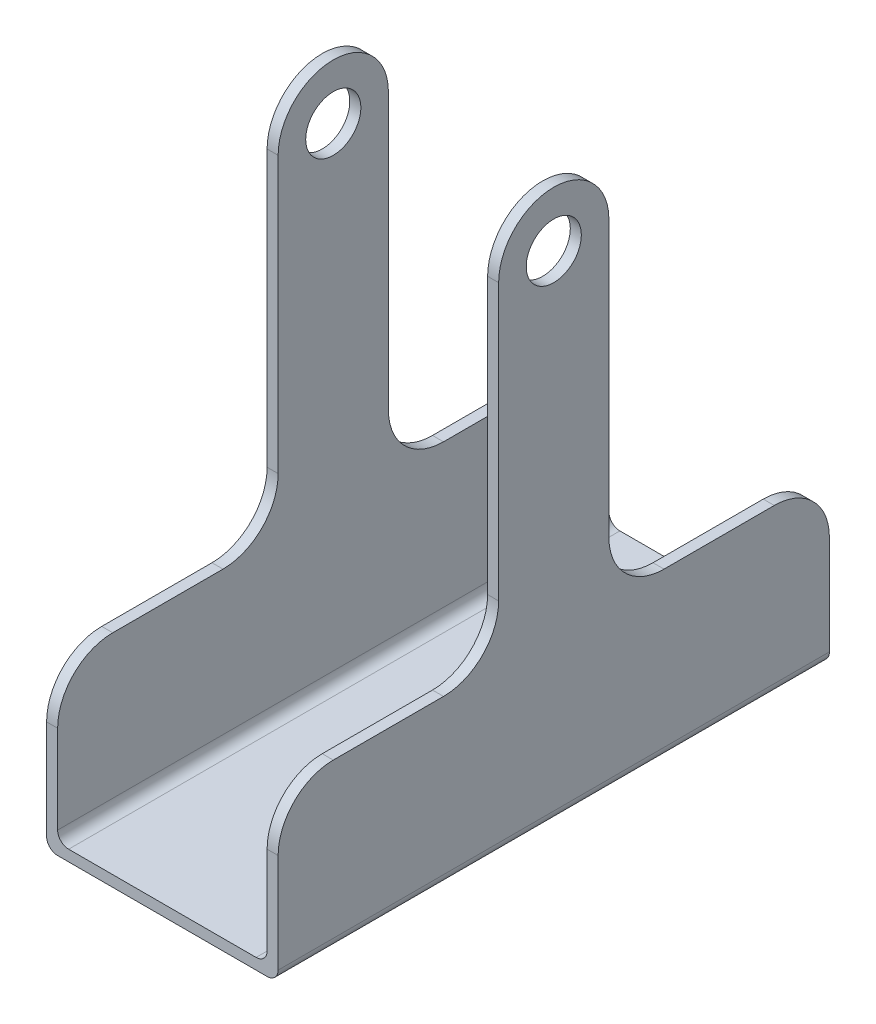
ISO-10303-21;
HEADER;
FILE_DESCRIPTION(('STEP AP214'),'2;1');
FILE_NAME('part.step','',(''),(''),'','','');
FILE_SCHEMA(('AUTOMOTIVE_DESIGN { 1 0 10303 214 1 1 1 1 }'));
ENDSEC;
DATA;
#1=APPLICATION_CONTEXT('core data for automotive mechanical design processes');
#2=APPLICATION_PROTOCOL_DEFINITION('international standard','automotive_design',2000,#1);
#3=PRODUCT_CONTEXT('',#1,'mechanical');
#4=PRODUCT('Part','Part','',(#3));
#5=PRODUCT_RELATED_PRODUCT_CATEGORY('part','',(#4));
#6=PRODUCT_DEFINITION_FORMATION('','',#4);
#7=PRODUCT_DEFINITION_CONTEXT('part definition',#1,'design');
#8=PRODUCT_DEFINITION('design','',#6,#7);
#9=PRODUCT_DEFINITION_SHAPE('','',#8);
#10=(LENGTH_UNIT() NAMED_UNIT(*) SI_UNIT(.MILLI.,.METRE.));
#11=(NAMED_UNIT(*) PLANE_ANGLE_UNIT() SI_UNIT($,.RADIAN.));
#12=(NAMED_UNIT(*) SI_UNIT($,.STERADIAN.) SOLID_ANGLE_UNIT());
#13=UNCERTAINTY_MEASURE_WITH_UNIT(LENGTH_MEASURE(1.E-05),#10,'distance_accuracy_value','');
#14=(GEOMETRIC_REPRESENTATION_CONTEXT(3) GLOBAL_UNCERTAINTY_ASSIGNED_CONTEXT((#13)) GLOBAL_UNIT_ASSIGNED_CONTEXT((#10,
#11,#12)) REPRESENTATION_CONTEXT('',''));
#15=CARTESIAN_POINT('',(0.,0.,0.));
#16=DIRECTION('',(0.,0.,1.));
#17=DIRECTION('',(1.,0.,0.));
#18=AXIS2_PLACEMENT_3D('',#15,#16,#17);
#19=CARTESIAN_POINT('',(0.,1.,0.));
#20=DIRECTION('',(0.,0.,-1.));
#21=DIRECTION('',(-1.,0.,0.));
#22=AXIS2_PLACEMENT_3D('',#19,#20,#21);
#23=PLANE('',#22);
#24=DIRECTION('',(1.,0.,0.));
#25=VECTOR('',#24,1.);
#26=CARTESIAN_POINT('',(0.,0.,0.));
#27=LINE('',#26,#25);
#28=CARTESIAN_POINT('',(0.,0.,0.));
#29=VERTEX_POINT('',#28);
#30=CARTESIAN_POINT('',(19.,0.,0.));
#31=VERTEX_POINT('',#30);
#32=EDGE_CURVE('E422',#29,#31,#27,.T.);
#33=ORIENTED_EDGE('',*,*,#32,.T.);
#34=CARTESIAN_POINT('',(19.,1.,0.));
#35=DIRECTION('',(0.,0.,-1.));
#36=DIRECTION('',(-1.,0.,0.));
#37=AXIS2_PLACEMENT_3D('',#34,#35,#36);
#38=CIRCLE('',#37,1.);
#39=CARTESIAN_POINT('',(20.,1.,0.));
#40=VERTEX_POINT('',#39);
#41=EDGE_CURVE('E37',#31,#40,#38,.F.);
#42=ORIENTED_EDGE('',*,*,#41,.T.);
#43=DIRECTION('',(0.,-1.,0.));
#44=VECTOR('',#43,1.);
#45=CARTESIAN_POINT('',(20.,0.,0.));
#46=LINE('',#45,#44);
#47=CARTESIAN_POINT('',(20.,9.99999999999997,0.));
#48=VERTEX_POINT('',#47);
#49=EDGE_CURVE('E399',#48,#40,#46,.T.);
#50=ORIENTED_EDGE('',*,*,#49,.F.);
#51=DIRECTION('',(-1.,0.,0.));
#52=VECTOR('',#51,1.);
#53=CARTESIAN_POINT('',(20.,9.99999999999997,0.));
#54=LINE('',#53,#52);
#55=CARTESIAN_POINT('',(19.,9.99999999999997,0.));
#56=VERTEX_POINT('',#55);
#57=EDGE_CURVE('E309',#48,#56,#54,.T.);
#58=ORIENTED_EDGE('',*,*,#57,.T.);
#59=DIRECTION('',(0.,-1.,0.));
#60=VECTOR('',#59,1.);
#61=CARTESIAN_POINT('',(19.,0.,0.));
#62=LINE('',#61,#60);
#63=CARTESIAN_POINT('',(19.,2.,0.));
#64=VERTEX_POINT('',#63);
#65=EDGE_CURVE('E385',#56,#64,#62,.T.);
#66=ORIENTED_EDGE('',*,*,#65,.T.);
#67=CARTESIAN_POINT('',(18.,2.,0.));
#68=DIRECTION('',(0.,0.,-1.));
#69=DIRECTION('',(-1.,0.,0.));
#70=AXIS2_PLACEMENT_3D('',#67,#68,#69);
#71=CIRCLE('',#70,1.);
#72=CARTESIAN_POINT('',(18.,1.,0.));
#73=VERTEX_POINT('',#72);
#74=EDGE_CURVE('E406',#64,#73,#71,.T.);
#75=ORIENTED_EDGE('',*,*,#74,.T.);
#76=DIRECTION('',(1.,0.,0.));
#77=VECTOR('',#76,1.);
#78=CARTESIAN_POINT('',(0.,1.,0.));
#79=LINE('',#78,#77);
#80=CARTESIAN_POINT('',(1.,1.,0.));
#81=VERTEX_POINT('',#80);
#82=EDGE_CURVE('E373',#81,#73,#79,.T.);
#83=ORIENTED_EDGE('',*,*,#82,.F.);
#84=CARTESIAN_POINT('',(1.,2.,0.));
#85=DIRECTION('',(0.,0.,-1.));
#86=DIRECTION('',(-1.,0.,0.));
#87=AXIS2_PLACEMENT_3D('',#84,#85,#86);
#88=CIRCLE('',#87,1.);
#89=CARTESIAN_POINT('',(0.,2.,0.));
#90=VERTEX_POINT('',#89);
#91=EDGE_CURVE('E364',#81,#90,#88,.T.);
#92=ORIENTED_EDGE('',*,*,#91,.T.);
#93=DIRECTION('',(0.,1.,0.));
#94=VECTOR('',#93,1.);
#95=CARTESIAN_POINT('',(0.,0.,0.));
#96=LINE('',#95,#94);
#97=CARTESIAN_POINT('',(0.,9.99999999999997,0.));
#98=VERTEX_POINT('',#97);
#99=EDGE_CURVE('E351',#90,#98,#96,.T.);
#100=ORIENTED_EDGE('',*,*,#99,.T.);
#101=CARTESIAN_POINT('',(-1.,9.99999999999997,0.));
#102=VERTEX_POINT('',#101);
#103=EDGE_CURVE('E312',#98,#102,#54,.T.);
#104=ORIENTED_EDGE('',*,*,#103,.T.);
#105=DIRECTION('',(0.,1.,0.));
#106=VECTOR('',#105,1.);
#107=CARTESIAN_POINT('',(-1.,0.,0.));
#108=LINE('',#107,#106);
#109=CARTESIAN_POINT('',(-1.,1.,0.));
#110=VERTEX_POINT('',#109);
#111=EDGE_CURVE('E506',#110,#102,#108,.T.);
#112=ORIENTED_EDGE('',*,*,#111,.F.);
#113=CARTESIAN_POINT('',(0.,1.,0.));
#114=DIRECTION('',(0.,0.,-1.));
#115=DIRECTION('',(-1.,0.,0.));
#116=AXIS2_PLACEMENT_3D('',#113,#114,#115);
#117=CIRCLE('',#116,1.);
#118=EDGE_CURVE('E44',#110,#29,#117,.F.);
#119=ORIENTED_EDGE('',*,*,#118,.T.);
#120=EDGE_LOOP('',(#33,#42,#50,#58,#66,#75,#83,#92,#100,#104,#112,#119));
#121=FACE_BOUND('',#120,.T.);
#122=ADVANCED_FACE('F30',(#121),#23,.F.);
#123=CARTESIAN_POINT('',(0.,1.,-50.));
#124=DIRECTION('',(0.,0.,1.));
#125=DIRECTION('',(1.,0.,0.));
#126=AXIS2_PLACEMENT_3D('',#123,#124,#125);
#127=PLANE('',#126);
#128=DIRECTION('',(0.,1.,0.));
#129=VECTOR('',#128,1.);
#130=CARTESIAN_POINT('',(20.,0.,-50.));
#131=LINE('',#130,#129);
#132=CARTESIAN_POINT('',(20.,1.,-50.));
#133=VERTEX_POINT('',#132);
#134=CARTESIAN_POINT('',(20.,9.99999999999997,-50.));
#135=VERTEX_POINT('',#134);
#136=EDGE_CURVE('E430',#133,#135,#131,.T.);
#137=ORIENTED_EDGE('',*,*,#136,.F.);
#138=CARTESIAN_POINT('',(19.,1.,-50.));
#139=DIRECTION('',(0.,0.,1.));
#140=DIRECTION('',(1.,0.,0.));
#141=AXIS2_PLACEMENT_3D('',#138,#139,#140);
#142=CIRCLE('',#141,1.);
#143=CARTESIAN_POINT('',(19.,0.,-50.));
#144=VERTEX_POINT('',#143);
#145=EDGE_CURVE('E413',#133,#144,#142,.F.);
#146=ORIENTED_EDGE('',*,*,#145,.T.);
#147=DIRECTION('',(-1.,0.,0.));
#148=VECTOR('',#147,1.);
#149=CARTESIAN_POINT('',(0.,0.,-50.));
#150=LINE('',#149,#148);
#151=CARTESIAN_POINT('',(0.,0.,-50.));
#152=VERTEX_POINT('',#151);
#153=EDGE_CURVE('E378',#144,#152,#150,.T.);
#154=ORIENTED_EDGE('',*,*,#153,.T.);
#155=CARTESIAN_POINT('',(0.,1.,-50.));
#156=DIRECTION('',(0.,0.,1.));
#157=DIRECTION('',(1.,0.,0.));
#158=AXIS2_PLACEMENT_3D('',#155,#156,#157);
#159=CIRCLE('',#158,1.);
#160=CARTESIAN_POINT('',(-1.,1.,-50.));
#161=VERTEX_POINT('',#160);
#162=EDGE_CURVE('E411',#152,#161,#159,.F.);
#163=ORIENTED_EDGE('',*,*,#162,.T.);
#164=DIRECTION('',(0.,-1.,0.));
#165=VECTOR('',#164,1.);
#166=CARTESIAN_POINT('',(-1.,0.,-50.));
#167=LINE('',#166,#165);
#168=CARTESIAN_POINT('',(-1.,9.99999999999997,-50.));
#169=VERTEX_POINT('',#168);
#170=EDGE_CURVE('E503',#169,#161,#167,.T.);
#171=ORIENTED_EDGE('',*,*,#170,.F.);
#172=DIRECTION('',(-1.,0.,0.));
#173=VECTOR('',#172,1.);
#174=CARTESIAN_POINT('',(20.,9.99999999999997,-50.));
#175=LINE('',#174,#173);
#176=CARTESIAN_POINT('',(0.,9.99999999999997,-50.));
#177=VERTEX_POINT('',#176);
#178=EDGE_CURVE('E308',#177,#169,#175,.T.);
#179=ORIENTED_EDGE('',*,*,#178,.F.);
#180=DIRECTION('',(0.,-1.,0.));
#181=VECTOR('',#180,1.);
#182=CARTESIAN_POINT('',(0.,0.,-50.));
#183=LINE('',#182,#181);
#184=CARTESIAN_POINT('',(0.,2.,-50.));
#185=VERTEX_POINT('',#184);
#186=EDGE_CURVE('E359',#177,#185,#183,.T.);
#187=ORIENTED_EDGE('',*,*,#186,.T.);
#188=CARTESIAN_POINT('',(1.,2.,-50.));
#189=DIRECTION('',(0.,0.,1.));
#190=DIRECTION('',(1.,0.,0.));
#191=AXIS2_PLACEMENT_3D('',#188,#189,#190);
#192=CIRCLE('',#191,1.);
#193=CARTESIAN_POINT('',(1.,1.,-50.));
#194=VERTEX_POINT('',#193);
#195=EDGE_CURVE('E366',#185,#194,#192,.T.);
#196=ORIENTED_EDGE('',*,*,#195,.T.);
#197=DIRECTION('',(-1.,0.,0.));
#198=VECTOR('',#197,1.);
#199=CARTESIAN_POINT('',(0.,1.,-50.));
#200=LINE('',#199,#198);
#201=CARTESIAN_POINT('',(18.,1.,-50.));
#202=VERTEX_POINT('',#201);
#203=EDGE_CURVE('E370',#202,#194,#200,.T.);
#204=ORIENTED_EDGE('',*,*,#203,.F.);
#205=CARTESIAN_POINT('',(18.,2.,-50.));
#206=DIRECTION('',(0.,0.,1.));
#207=DIRECTION('',(1.,0.,0.));
#208=AXIS2_PLACEMENT_3D('',#205,#206,#207);
#209=CIRCLE('',#208,1.);
#210=CARTESIAN_POINT('',(19.,2.,-50.));
#211=VERTEX_POINT('',#210);
#212=EDGE_CURVE('E404',#202,#211,#209,.T.);
#213=ORIENTED_EDGE('',*,*,#212,.T.);
#214=DIRECTION('',(0.,1.,0.));
#215=VECTOR('',#214,1.);
#216=CARTESIAN_POINT('',(19.,0.,-50.));
#217=LINE('',#216,#215);
#218=CARTESIAN_POINT('',(19.,9.99999999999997,-50.));
#219=VERTEX_POINT('',#218);
#220=EDGE_CURVE('E389',#211,#219,#217,.T.);
#221=ORIENTED_EDGE('',*,*,#220,.T.);
#222=EDGE_CURVE('E305',#135,#219,#175,.T.);
#223=ORIENTED_EDGE('',*,*,#222,.F.);
#224=EDGE_LOOP('',(#137,#146,#154,#163,#171,#179,#187,#196,#204,#213,#221,#223));
#225=FACE_BOUND('',#224,.T.);
#226=ADVANCED_FACE('F434',(#225),#127,.F.);
#227=CARTESIAN_POINT('',(0.,1.,-50.));
#228=DIRECTION('',(0.,-1.,0.));
#229=DIRECTION('',(0.,0.,-1.));
#230=AXIS2_PLACEMENT_3D('',#227,#228,#229);
#231=PLANE('',#230);
#232=ORIENTED_EDGE('',*,*,#82,.T.);
#233=DIRECTION('',(0.,0.,-1.));
#234=VECTOR('',#233,1.);
#235=CARTESIAN_POINT('',(18.,1.,-50.));
#236=LINE('',#235,#234);
#237=EDGE_CURVE('E369',#73,#202,#236,.T.);
#238=ORIENTED_EDGE('',*,*,#237,.T.);
#239=ORIENTED_EDGE('',*,*,#203,.T.);
#240=DIRECTION('',(0.,0.,1.));
#241=VECTOR('',#240,1.);
#242=CARTESIAN_POINT('',(1.,1.,0.));
#243=LINE('',#242,#241);
#244=EDGE_CURVE('E360',#194,#81,#243,.T.);
#245=ORIENTED_EDGE('',*,*,#244,.T.);
#246=EDGE_LOOP('',(#232,#238,#239,#245));
#247=FACE_BOUND('',#246,.T.);
#248=ADVANCED_FACE('F459',(#247),#231,.F.);
#249=CARTESIAN_POINT('',(0.,0.,-50.));
#250=DIRECTION('',(0.,-1.,0.));
#251=DIRECTION('',(0.,0.,-1.));
#252=AXIS2_PLACEMENT_3D('',#249,#250,#251);
#253=PLANE('',#252);
#254=ORIENTED_EDGE('',*,*,#153,.F.);
#255=DIRECTION('',(0.,0.,-1.));
#256=VECTOR('',#255,1.);
#257=CARTESIAN_POINT('',(19.,0.,0.));
#258=LINE('',#257,#256);
#259=EDGE_CURVE('E51',#144,#31,#258,.F.);
#260=ORIENTED_EDGE('',*,*,#259,.T.);
#261=ORIENTED_EDGE('',*,*,#32,.F.);
#262=DIRECTION('',(0.,0.,1.));
#263=VECTOR('',#262,1.);
#264=CARTESIAN_POINT('',(0.,0.,-50.));
#265=LINE('',#264,#263);
#266=EDGE_CURVE('E415',#29,#152,#265,.F.);
#267=ORIENTED_EDGE('',*,*,#266,.T.);
#268=EDGE_LOOP('',(#254,#260,#261,#267));
#269=FACE_BOUND('',#268,.T.);
#270=ADVANCED_FACE('F437',(#269),#253,.T.);
#271=CARTESIAN_POINT('',(19.,50.,0.));
#272=DIRECTION('',(-1.,0.,0.));
#273=DIRECTION('',(0.,0.,1.));
#274=AXIS2_PLACEMENT_3D('',#271,#272,#273);
#275=PLANE('',#274);
#276=ORIENTED_EDGE('',*,*,#220,.F.);
#277=DIRECTION('',(0.,0.,-1.));
#278=VECTOR('',#277,1.);
#279=CARTESIAN_POINT('',(19.,2.,0.));
#280=LINE('',#279,#278);
#281=EDGE_CURVE('E402',#211,#64,#280,.F.);
#282=ORIENTED_EDGE('',*,*,#281,.T.);
#283=ORIENTED_EDGE('',*,*,#65,.F.);
#284=CARTESIAN_POINT('',(19.,10.,-5.));
#285=DIRECTION('',(-1.,0.,0.));
#286=DIRECTION('',(0.,0.,1.));
#287=AXIS2_PLACEMENT_3D('',#284,#285,#286);
#288=CIRCLE('',#287,5.);
#289=CARTESIAN_POINT('',(19.,15.,-5.00000000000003));
#290=VERTEX_POINT('',#289);
#291=EDGE_CURVE('E335',#290,#56,#288,.F.);
#292=ORIENTED_EDGE('',*,*,#291,.F.);
#293=DIRECTION('',(0.,0.,1.));
#294=VECTOR('',#293,1.);
#295=CARTESIAN_POINT('',(19.,15.,0.));
#296=LINE('',#295,#294);
#297=CARTESIAN_POINT('',(19.,15.,-15.));
#298=VERTEX_POINT('',#297);
#299=EDGE_CURVE('E333',#298,#290,#296,.T.);
#300=ORIENTED_EDGE('',*,*,#299,.F.);
#301=CARTESIAN_POINT('',(19.,20.,-15.));
#302=DIRECTION('',(-1.,0.,0.));
#303=DIRECTION('',(0.,0.,1.));
#304=AXIS2_PLACEMENT_3D('',#301,#302,#303);
#305=CIRCLE('',#304,5.);
#306=CARTESIAN_POINT('',(19.,20.,-20.));
#307=VERTEX_POINT('',#306);
#308=EDGE_CURVE('E331',#307,#298,#305,.T.);
#309=ORIENTED_EDGE('',*,*,#308,.F.);
#310=DIRECTION('',(0.,-1.,0.));
#311=VECTOR('',#310,1.);
#312=CARTESIAN_POINT('',(19.,50.,-20.));
#313=LINE('',#312,#311);
#314=CARTESIAN_POINT('',(19.,45.,-20.));
#315=VERTEX_POINT('',#314);
#316=EDGE_CURVE('E329',#315,#307,#313,.T.);
#317=ORIENTED_EDGE('',*,*,#316,.F.);
#318=CARTESIAN_POINT('',(19.,45.,-25.));
#319=DIRECTION('',(-1.,0.,0.));
#320=DIRECTION('',(0.,0.,1.));
#321=AXIS2_PLACEMENT_3D('',#318,#319,#320);
#322=CIRCLE('',#321,5.);
#323=CARTESIAN_POINT('',(19.,45.,-30.));
#324=VERTEX_POINT('',#323);
#325=EDGE_CURVE('E327',#324,#315,#322,.F.);
#326=ORIENTED_EDGE('',*,*,#325,.F.);
#327=DIRECTION('',(0.,1.,0.));
#328=VECTOR('',#327,1.);
#329=CARTESIAN_POINT('',(19.,50.,-30.));
#330=LINE('',#329,#328);
#331=CARTESIAN_POINT('',(19.,20.,-30.));
#332=VERTEX_POINT('',#331);
#333=EDGE_CURVE('E343',#332,#324,#330,.T.);
#334=ORIENTED_EDGE('',*,*,#333,.F.);
#335=CARTESIAN_POINT('',(19.,20.,-35.));
#336=DIRECTION('',(-1.,0.,0.));
#337=DIRECTION('',(0.,0.,1.));
#338=AXIS2_PLACEMENT_3D('',#335,#336,#337);
#339=CIRCLE('',#338,5.);
#340=CARTESIAN_POINT('',(19.,15.,-35.));
#341=VERTEX_POINT('',#340);
#342=EDGE_CURVE('E341',#341,#332,#339,.T.);
#343=ORIENTED_EDGE('',*,*,#342,.F.);
#344=DIRECTION('',(0.,0.,1.));
#345=VECTOR('',#344,1.);
#346=CARTESIAN_POINT('',(19.,15.,0.));
#347=LINE('',#346,#345);
#348=CARTESIAN_POINT('',(19.,15.,-45.));
#349=VERTEX_POINT('',#348);
#350=EDGE_CURVE('E339',#349,#341,#347,.T.);
#351=ORIENTED_EDGE('',*,*,#350,.F.);
#352=CARTESIAN_POINT('',(19.,10.,-45.));
#353=DIRECTION('',(-1.,0.,0.));
#354=DIRECTION('',(0.,0.,1.));
#355=AXIS2_PLACEMENT_3D('',#352,#353,#354);
#356=CIRCLE('',#355,5.);
#357=EDGE_CURVE('E337',#219,#349,#356,.F.);
#358=ORIENTED_EDGE('',*,*,#357,.F.);
#359=EDGE_LOOP('',(#276,#282,#283,#292,#300,#309,#317,#326,#334,#343,#351,#358));
#360=FACE_BOUND('',#359,.T.);
#361=CARTESIAN_POINT('',(19.,45.,-25.));
#362=DIRECTION('',(1.,0.,0.));
#363=DIRECTION('',(0.,0.,-1.));
#364=AXIS2_PLACEMENT_3D('',#361,#362,#363);
#365=CIRCLE('',#364,2.5);
#366=CARTESIAN_POINT('',(19.,45.,-27.5));
#367=VERTEX_POINT('',#366);
#368=EDGE_CURVE('E505',#367,#367,#365,.T.);
#369=ORIENTED_EDGE('',*,*,#368,.T.);
#370=EDGE_LOOP('',(#369));
#371=FACE_BOUND('',#370,.T.);
#372=ADVANCED_FACE('F447',(#360,#371),#275,.T.);
#373=CARTESIAN_POINT('',(20.,50.,0.));
#374=DIRECTION('',(-1.,0.,0.));
#375=DIRECTION('',(0.,0.,1.));
#376=AXIS2_PLACEMENT_3D('',#373,#374,#375);
#377=PLANE('',#376);
#378=ORIENTED_EDGE('',*,*,#49,.T.);
#379=DIRECTION('',(0.,0.,-1.));
#380=VECTOR('',#379,1.);
#381=CARTESIAN_POINT('',(20.,1.,-50.));
#382=LINE('',#381,#380);
#383=EDGE_CURVE('E408',#40,#133,#382,.T.);
#384=ORIENTED_EDGE('',*,*,#383,.T.);
#385=ORIENTED_EDGE('',*,*,#136,.T.);
#386=CARTESIAN_POINT('',(20.,10.,-45.));
#387=DIRECTION('',(1.,0.,0.));
#388=DIRECTION('',(0.,0.,-1.));
#389=AXIS2_PLACEMENT_3D('',#386,#387,#388);
#390=CIRCLE('',#389,5.);
#391=CARTESIAN_POINT('',(20.,15.,-45.));
#392=VERTEX_POINT('',#391);
#393=EDGE_CURVE('E278',#135,#392,#390,.T.);
#394=ORIENTED_EDGE('',*,*,#393,.T.);
#395=DIRECTION('',(0.,0.,1.));
#396=VECTOR('',#395,1.);
#397=CARTESIAN_POINT('',(20.,15.,-35.));
#398=LINE('',#397,#396);
#399=CARTESIAN_POINT('',(20.,15.,-35.));
#400=VERTEX_POINT('',#399);
#401=EDGE_CURVE('E281',#392,#400,#398,.T.);
#402=ORIENTED_EDGE('',*,*,#401,.T.);
#403=CARTESIAN_POINT('',(20.,20.,-35.));
#404=DIRECTION('',(-1.,0.,0.));
#405=DIRECTION('',(0.,0.,1.));
#406=AXIS2_PLACEMENT_3D('',#403,#404,#405);
#407=CIRCLE('',#406,5.);
#408=CARTESIAN_POINT('',(20.,20.,-30.));
#409=VERTEX_POINT('',#408);
#410=EDGE_CURVE('E284',#400,#409,#407,.T.);
#411=ORIENTED_EDGE('',*,*,#410,.T.);
#412=DIRECTION('',(0.,1.,0.));
#413=VECTOR('',#412,1.);
#414=CARTESIAN_POINT('',(20.,45.,-30.));
#415=LINE('',#414,#413);
#416=CARTESIAN_POINT('',(20.,45.,-30.));
#417=VERTEX_POINT('',#416);
#418=EDGE_CURVE('E227',#409,#417,#415,.T.);
#419=ORIENTED_EDGE('',*,*,#418,.T.);
#420=CARTESIAN_POINT('',(20.,45.,-25.));
#421=DIRECTION('',(1.,0.,0.));
#422=DIRECTION('',(0.,0.,1.));
#423=AXIS2_PLACEMENT_3D('',#420,#421,#422);
#424=CIRCLE('',#423,5.);
#425=CARTESIAN_POINT('',(20.,45.,-20.));
#426=VERTEX_POINT('',#425);
#427=EDGE_CURVE('E264',#417,#426,#424,.T.);
#428=ORIENTED_EDGE('',*,*,#427,.T.);
#429=DIRECTION('',(0.,-1.,0.));
#430=VECTOR('',#429,1.);
#431=CARTESIAN_POINT('',(20.,45.,-20.));
#432=LINE('',#431,#430);
#433=CARTESIAN_POINT('',(20.,20.,-20.));
#434=VERTEX_POINT('',#433);
#435=EDGE_CURVE('E266',#426,#434,#432,.T.);
#436=ORIENTED_EDGE('',*,*,#435,.T.);
#437=CARTESIAN_POINT('',(20.,20.,-15.));
#438=DIRECTION('',(-1.,0.,0.));
#439=DIRECTION('',(0.,0.,-1.));
#440=AXIS2_PLACEMENT_3D('',#437,#438,#439);
#441=CIRCLE('',#440,5.);
#442=CARTESIAN_POINT('',(20.,15.,-15.));
#443=VERTEX_POINT('',#442);
#444=EDGE_CURVE('E269',#434,#443,#441,.T.);
#445=ORIENTED_EDGE('',*,*,#444,.T.);
#446=DIRECTION('',(0.,0.,1.));
#447=VECTOR('',#446,1.);
#448=CARTESIAN_POINT('',(20.,15.,-15.));
#449=LINE('',#448,#447);
#450=CARTESIAN_POINT('',(20.,15.,-5.00000000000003));
#451=VERTEX_POINT('',#450);
#452=EDGE_CURVE('E272',#443,#451,#449,.T.);
#453=ORIENTED_EDGE('',*,*,#452,.T.);
#454=CARTESIAN_POINT('',(20.,10.,-5.));
#455=DIRECTION('',(1.,0.,0.));
#456=DIRECTION('',(0.,0.,1.));
#457=AXIS2_PLACEMENT_3D('',#454,#455,#456);
#458=CIRCLE('',#457,5.);
#459=EDGE_CURVE('E275',#451,#48,#458,.T.);
#460=ORIENTED_EDGE('',*,*,#459,.T.);
#461=EDGE_LOOP('',(#378,#384,#385,#394,#402,#411,#419,#428,#436,#445,#453,#460));
#462=FACE_BOUND('',#461,.T.);
#463=CARTESIAN_POINT('',(20.,45.,-25.));
#464=DIRECTION('',(1.,0.,0.));
#465=DIRECTION('',(0.,0.,-1.));
#466=AXIS2_PLACEMENT_3D('',#463,#464,#465);
#467=CIRCLE('',#466,2.5);
#468=CARTESIAN_POINT('',(20.,45.,-27.5));
#469=VERTEX_POINT('',#468);
#470=EDGE_CURVE('E390',#469,#469,#467,.T.);
#471=ORIENTED_EDGE('',*,*,#470,.F.);
#472=EDGE_LOOP('',(#471));
#473=FACE_BOUND('',#472,.T.);
#474=ADVANCED_FACE('F426',(#462,#473),#377,.F.);
#475=CARTESIAN_POINT('',(20.,45.,-25.));
#476=DIRECTION('',(-1.,0.,0.));
#477=DIRECTION('',(0.,0.,1.));
#478=AXIS2_PLACEMENT_3D('',#475,#476,#477);
#479=CYLINDRICAL_SURFACE('',#478,2.5);
#480=ORIENTED_EDGE('',*,*,#470,.T.);
#481=EDGE_LOOP('',(#480));
#482=FACE_BOUND('',#481,.T.);
#483=ORIENTED_EDGE('',*,*,#368,.F.);
#484=EDGE_LOOP('',(#483));
#485=FACE_BOUND('',#484,.T.);
#486=ADVANCED_FACE('F550',(#482,#485),#479,.F.);
#487=CARTESIAN_POINT('',(-1.,0.,0.));
#488=DIRECTION('',(-1.,0.,0.));
#489=DIRECTION('',(0.,0.,1.));
#490=AXIS2_PLACEMENT_3D('',#487,#488,#489);
#491=PLANE('',#490);
#492=ORIENTED_EDGE('',*,*,#170,.T.);
#493=DIRECTION('',(0.,0.,1.));
#494=VECTOR('',#493,1.);
#495=CARTESIAN_POINT('',(-1.,1.,0.));
#496=LINE('',#495,#494);
#497=EDGE_CURVE('E11',#161,#110,#496,.T.);
#498=ORIENTED_EDGE('',*,*,#497,.T.);
#499=ORIENTED_EDGE('',*,*,#111,.T.);
#500=CARTESIAN_POINT('',(-1.,10.,-5.));
#501=DIRECTION('',(1.,0.,0.));
#502=DIRECTION('',(0.,0.,1.));
#503=AXIS2_PLACEMENT_3D('',#500,#501,#502);
#504=CIRCLE('',#503,5.);
#505=CARTESIAN_POINT('',(-1.,15.,-5.00000000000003));
#506=VERTEX_POINT('',#505);
#507=EDGE_CURVE('E250',#506,#102,#504,.T.);
#508=ORIENTED_EDGE('',*,*,#507,.F.);
#509=DIRECTION('',(0.,0.,1.));
#510=VECTOR('',#509,1.);
#511=CARTESIAN_POINT('',(-1.,15.,-15.));
#512=LINE('',#511,#510);
#513=CARTESIAN_POINT('',(-1.,15.,-15.));
#514=VERTEX_POINT('',#513);
#515=EDGE_CURVE('E245',#514,#506,#512,.T.);
#516=ORIENTED_EDGE('',*,*,#515,.F.);
#517=CARTESIAN_POINT('',(-1.,20.,-15.));
#518=DIRECTION('',(-1.,0.,0.));
#519=DIRECTION('',(0.,0.,-1.));
#520=AXIS2_PLACEMENT_3D('',#517,#518,#519);
#521=CIRCLE('',#520,5.);
#522=CARTESIAN_POINT('',(-1.,20.,-20.));
#523=VERTEX_POINT('',#522);
#524=EDGE_CURVE('E243',#523,#514,#521,.T.);
#525=ORIENTED_EDGE('',*,*,#524,.F.);
#526=DIRECTION('',(0.,-1.,0.));
#527=VECTOR('',#526,1.);
#528=CARTESIAN_POINT('',(-1.,45.,-20.));
#529=LINE('',#528,#527);
#530=CARTESIAN_POINT('',(-1.,45.,-20.));
#531=VERTEX_POINT('',#530);
#532=EDGE_CURVE('E221',#531,#523,#529,.T.);
#533=ORIENTED_EDGE('',*,*,#532,.F.);
#534=CARTESIAN_POINT('',(-1.,45.,-25.));
#535=DIRECTION('',(1.,0.,0.));
#536=DIRECTION('',(0.,0.,1.));
#537=AXIS2_PLACEMENT_3D('',#534,#535,#536);
#538=CIRCLE('',#537,5.);
#539=CARTESIAN_POINT('',(-1.,45.,-30.));
#540=VERTEX_POINT('',#539);
#541=EDGE_CURVE('E230',#540,#531,#538,.T.);
#542=ORIENTED_EDGE('',*,*,#541,.F.);
#543=DIRECTION('',(0.,1.,0.));
#544=VECTOR('',#543,1.);
#545=CARTESIAN_POINT('',(-1.,45.,-30.));
#546=LINE('',#545,#544);
#547=CARTESIAN_POINT('',(-1.,20.,-30.));
#548=VERTEX_POINT('',#547);
#549=EDGE_CURVE('E262',#548,#540,#546,.T.);
#550=ORIENTED_EDGE('',*,*,#549,.F.);
#551=CARTESIAN_POINT('',(-1.,20.,-35.));
#552=DIRECTION('',(-1.,0.,0.));
#553=DIRECTION('',(0.,0.,1.));
#554=AXIS2_PLACEMENT_3D('',#551,#552,#553);
#555=CIRCLE('',#554,5.);
#556=CARTESIAN_POINT('',(-1.,15.,-35.));
#557=VERTEX_POINT('',#556);
#558=EDGE_CURVE('E259',#557,#548,#555,.T.);
#559=ORIENTED_EDGE('',*,*,#558,.F.);
#560=DIRECTION('',(0.,0.,1.));
#561=VECTOR('',#560,1.);
#562=CARTESIAN_POINT('',(-1.,15.,-35.));
#563=LINE('',#562,#561);
#564=CARTESIAN_POINT('',(-1.,15.,-45.));
#565=VERTEX_POINT('',#564);
#566=EDGE_CURVE('E256',#565,#557,#563,.T.);
#567=ORIENTED_EDGE('',*,*,#566,.F.);
#568=CARTESIAN_POINT('',(-1.,10.,-45.));
#569=DIRECTION('',(1.,0.,0.));
#570=DIRECTION('',(0.,0.,-1.));
#571=AXIS2_PLACEMENT_3D('',#568,#569,#570);
#572=CIRCLE('',#571,5.);
#573=EDGE_CURVE('E253',#169,#565,#572,.T.);
#574=ORIENTED_EDGE('',*,*,#573,.F.);
#575=EDGE_LOOP('',(#492,#498,#499,#508,#516,#525,#533,#542,#550,#559,#567,#574));
#576=FACE_BOUND('',#575,.T.);
#577=CARTESIAN_POINT('',(-1.,45.,-25.));
#578=DIRECTION('',(-1.,0.,0.));
#579=DIRECTION('',(0.,0.,1.));
#580=AXIS2_PLACEMENT_3D('',#577,#578,#579);
#581=CIRCLE('',#580,2.5);
#582=CARTESIAN_POINT('',(-1.,45.,-22.5));
#583=VERTEX_POINT('',#582);
#584=EDGE_CURVE('E348',#583,#583,#581,.T.);
#585=ORIENTED_EDGE('',*,*,#584,.F.);
#586=EDGE_LOOP('',(#585));
#587=FACE_BOUND('',#586,.T.);
#588=ADVANCED_FACE('F239',(#576,#587),#491,.T.);
#589=CARTESIAN_POINT('',(0.,0.,0.));
#590=DIRECTION('',(-1.,0.,0.));
#591=DIRECTION('',(0.,0.,1.));
#592=AXIS2_PLACEMENT_3D('',#589,#590,#591);
#593=PLANE('',#592);
#594=ORIENTED_EDGE('',*,*,#99,.F.);
#595=DIRECTION('',(0.,0.,1.));
#596=VECTOR('',#595,1.);
#597=CARTESIAN_POINT('',(0.,2.,-50.));
#598=LINE('',#597,#596);
#599=EDGE_CURVE('E362',#90,#185,#598,.F.);
#600=ORIENTED_EDGE('',*,*,#599,.T.);
#601=ORIENTED_EDGE('',*,*,#186,.F.);
#602=CARTESIAN_POINT('',(0.,10.,-45.));
#603=DIRECTION('',(-1.,0.,0.));
#604=DIRECTION('',(0.,0.,1.));
#605=AXIS2_PLACEMENT_3D('',#602,#603,#604);
#606=CIRCLE('',#605,5.);
#607=CARTESIAN_POINT('',(0.,15.,-45.));
#608=VERTEX_POINT('',#607);
#609=EDGE_CURVE('E391',#177,#608,#606,.F.);
#610=ORIENTED_EDGE('',*,*,#609,.T.);
#611=DIRECTION('',(0.,0.,1.));
#612=VECTOR('',#611,1.);
#613=CARTESIAN_POINT('',(0.,15.,0.));
#614=LINE('',#613,#612);
#615=CARTESIAN_POINT('',(0.,15.,-35.));
#616=VERTEX_POINT('',#615);
#617=EDGE_CURVE('E464',#608,#616,#614,.T.);
#618=ORIENTED_EDGE('',*,*,#617,.T.);
#619=CARTESIAN_POINT('',(0.,20.,-35.));
#620=DIRECTION('',(-1.,0.,0.));
#621=DIRECTION('',(0.,0.,1.));
#622=AXIS2_PLACEMENT_3D('',#619,#620,#621);
#623=CIRCLE('',#622,5.);
#624=CARTESIAN_POINT('',(0.,20.,-30.));
#625=VERTEX_POINT('',#624);
#626=EDGE_CURVE('E468',#616,#625,#623,.T.);
#627=ORIENTED_EDGE('',*,*,#626,.T.);
#628=DIRECTION('',(0.,1.,0.));
#629=VECTOR('',#628,1.);
#630=CARTESIAN_POINT('',(0.,0.,-30.));
#631=LINE('',#630,#629);
#632=CARTESIAN_POINT('',(0.,45.,-30.));
#633=VERTEX_POINT('',#632);
#634=EDGE_CURVE('E470',#625,#633,#631,.T.);
#635=ORIENTED_EDGE('',*,*,#634,.T.);
#636=CARTESIAN_POINT('',(0.,45.,-25.));
#637=DIRECTION('',(-1.,0.,0.));
#638=DIRECTION('',(0.,0.,1.));
#639=AXIS2_PLACEMENT_3D('',#636,#637,#638);
#640=CIRCLE('',#639,5.);
#641=CARTESIAN_POINT('',(0.,45.,-20.));
#642=VERTEX_POINT('',#641);
#643=EDGE_CURVE('E292',#633,#642,#640,.F.);
#644=ORIENTED_EDGE('',*,*,#643,.T.);
#645=DIRECTION('',(0.,-1.,0.));
#646=VECTOR('',#645,1.);
#647=CARTESIAN_POINT('',(0.,0.,-20.));
#648=LINE('',#647,#646);
#649=CARTESIAN_POINT('',(0.,20.,-20.));
#650=VERTEX_POINT('',#649);
#651=EDGE_CURVE('E224',#642,#650,#648,.T.);
#652=ORIENTED_EDGE('',*,*,#651,.T.);
#653=CARTESIAN_POINT('',(0.,20.,-15.));
#654=DIRECTION('',(-1.,0.,0.));
#655=DIRECTION('',(0.,0.,1.));
#656=AXIS2_PLACEMENT_3D('',#653,#654,#655);
#657=CIRCLE('',#656,5.);
#658=CARTESIAN_POINT('',(0.,15.,-15.));
#659=VERTEX_POINT('',#658);
#660=EDGE_CURVE('E481',#650,#659,#657,.T.);
#661=ORIENTED_EDGE('',*,*,#660,.T.);
#662=DIRECTION('',(0.,0.,1.));
#663=VECTOR('',#662,1.);
#664=CARTESIAN_POINT('',(0.,15.,0.));
#665=LINE('',#664,#663);
#666=CARTESIAN_POINT('',(0.,15.,-5.00000000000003));
#667=VERTEX_POINT('',#666);
#668=EDGE_CURVE('E478',#659,#667,#665,.T.);
#669=ORIENTED_EDGE('',*,*,#668,.T.);
#670=CARTESIAN_POINT('',(0.,10.,-5.));
#671=DIRECTION('',(-1.,0.,0.));
#672=DIRECTION('',(0.,0.,1.));
#673=AXIS2_PLACEMENT_3D('',#670,#671,#672);
#674=CIRCLE('',#673,5.);
#675=EDGE_CURVE('E475',#667,#98,#674,.F.);
#676=ORIENTED_EDGE('',*,*,#675,.T.);
#677=EDGE_LOOP('',(#594,#600,#601,#610,#618,#627,#635,#644,#652,#661,#669,#676));
#678=FACE_BOUND('',#677,.T.);
#679=CARTESIAN_POINT('',(0.,45.,-25.));
#680=DIRECTION('',(-1.,0.,0.));
#681=DIRECTION('',(0.,0.,1.));
#682=AXIS2_PLACEMENT_3D('',#679,#680,#681);
#683=CIRCLE('',#682,2.5);
#684=CARTESIAN_POINT('',(0.,45.,-22.5));
#685=VERTEX_POINT('',#684);
#686=EDGE_CURVE('E345',#685,#685,#683,.T.);
#687=ORIENTED_EDGE('',*,*,#686,.T.);
#688=EDGE_LOOP('',(#687));
#689=FACE_BOUND('',#688,.T.);
#690=ADVANCED_FACE('F484',(#678,#689),#593,.F.);
#691=CARTESIAN_POINT('',(-1.,45.,-25.));
#692=DIRECTION('',(1.,0.,0.));
#693=DIRECTION('',(0.,0.,-1.));
#694=AXIS2_PLACEMENT_3D('',#691,#692,#693);
#695=CYLINDRICAL_SURFACE('',#694,2.5);
#696=ORIENTED_EDGE('',*,*,#584,.T.);
#697=EDGE_LOOP('',(#696));
#698=FACE_BOUND('',#697,.T.);
#699=ORIENTED_EDGE('',*,*,#686,.F.);
#700=EDGE_LOOP('',(#699));
#701=FACE_BOUND('',#700,.T.);
#702=ADVANCED_FACE('F532',(#698,#701),#695,.F.);
#703=CARTESIAN_POINT('',(20.,45.,-20.));
#704=DIRECTION('',(0.,0.,-1.));
#705=DIRECTION('',(-1.,0.,0.));
#706=AXIS2_PLACEMENT_3D('',#703,#704,#705);
#707=PLANE('',#706);
#708=DIRECTION('',(-1.,0.,0.));
#709=VECTOR('',#708,1.);
#710=CARTESIAN_POINT('',(20.,45.,-20.));
#711=LINE('',#710,#709);
#712=EDGE_CURVE('E217',#642,#531,#711,.T.);
#713=ORIENTED_EDGE('',*,*,#712,.T.);
#714=ORIENTED_EDGE('',*,*,#532,.T.);
#715=DIRECTION('',(-1.,0.,0.));
#716=VECTOR('',#715,1.);
#717=CARTESIAN_POINT('',(20.,20.,-20.));
#718=LINE('',#717,#716);
#719=EDGE_CURVE('E323',#650,#523,#718,.T.);
#720=ORIENTED_EDGE('',*,*,#719,.F.);
#721=ORIENTED_EDGE('',*,*,#651,.F.);
#722=EDGE_LOOP('',(#713,#714,#720,#721));
#723=FACE_BOUND('',#722,.T.);
#724=ADVANCED_FACE('F219',(#723),#707,.F.);
#725=CARTESIAN_POINT('',(20.,20.,-15.));
#726=DIRECTION('',(-1.,0.,0.));
#727=DIRECTION('',(0.,0.,1.));
#728=AXIS2_PLACEMENT_3D('',#725,#726,#727);
#729=CYLINDRICAL_SURFACE('',#728,5.);
#730=ORIENTED_EDGE('',*,*,#719,.T.);
#731=ORIENTED_EDGE('',*,*,#524,.T.);
#732=DIRECTION('',(-1.,0.,0.));
#733=VECTOR('',#732,1.);
#734=CARTESIAN_POINT('',(20.,15.,-15.));
#735=LINE('',#734,#733);
#736=EDGE_CURVE('E320',#659,#514,#735,.T.);
#737=ORIENTED_EDGE('',*,*,#736,.F.);
#738=ORIENTED_EDGE('',*,*,#660,.F.);
#739=EDGE_LOOP('',(#730,#731,#737,#738));
#740=FACE_BOUND('',#739,.T.);
#741=ADVANCED_FACE('F522',(#740),#729,.F.);
#742=CARTESIAN_POINT('',(20.,15.,-15.));
#743=DIRECTION('',(0.,-1.,0.));
#744=DIRECTION('',(0.,0.,-1.));
#745=AXIS2_PLACEMENT_3D('',#742,#743,#744);
#746=PLANE('',#745);
#747=ORIENTED_EDGE('',*,*,#736,.T.);
#748=ORIENTED_EDGE('',*,*,#515,.T.);
#749=DIRECTION('',(-1.,0.,0.));
#750=VECTOR('',#749,1.);
#751=CARTESIAN_POINT('',(20.,15.,-5.00000000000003));
#752=LINE('',#751,#750);
#753=EDGE_CURVE('E316',#667,#506,#752,.T.);
#754=ORIENTED_EDGE('',*,*,#753,.F.);
#755=ORIENTED_EDGE('',*,*,#668,.F.);
#756=EDGE_LOOP('',(#747,#748,#754,#755));
#757=FACE_BOUND('',#756,.T.);
#758=ADVANCED_FACE('F519',(#757),#746,.F.);
#759=CARTESIAN_POINT('',(20.,10.,-5.));
#760=DIRECTION('',(-1.,0.,0.));
#761=DIRECTION('',(0.,0.,1.));
#762=AXIS2_PLACEMENT_3D('',#759,#760,#761);
#763=CYLINDRICAL_SURFACE('',#762,5.);
#764=ORIENTED_EDGE('',*,*,#753,.T.);
#765=ORIENTED_EDGE('',*,*,#507,.T.);
#766=ORIENTED_EDGE('',*,*,#103,.F.);
#767=ORIENTED_EDGE('',*,*,#675,.F.);
#768=EDGE_LOOP('',(#764,#765,#766,#767));
#769=FACE_BOUND('',#768,.T.);
#770=ADVANCED_FACE('F516',(#769),#763,.T.);
#771=CARTESIAN_POINT('',(20.,10.,-45.));
#772=DIRECTION('',(-1.,0.,0.));
#773=DIRECTION('',(0.,0.,1.));
#774=AXIS2_PLACEMENT_3D('',#771,#772,#773);
#775=CYLINDRICAL_SURFACE('',#774,5.);
#776=ORIENTED_EDGE('',*,*,#178,.T.);
#777=ORIENTED_EDGE('',*,*,#573,.T.);
#778=DIRECTION('',(-1.,0.,0.));
#779=VECTOR('',#778,1.);
#780=CARTESIAN_POINT('',(20.,15.,-45.));
#781=LINE('',#780,#779);
#782=EDGE_CURVE('E304',#608,#565,#781,.T.);
#783=ORIENTED_EDGE('',*,*,#782,.F.);
#784=ORIENTED_EDGE('',*,*,#609,.F.);
#785=EDGE_LOOP('',(#776,#777,#783,#784));
#786=FACE_BOUND('',#785,.T.);
#787=ADVANCED_FACE('F500',(#786),#775,.T.);
#788=CARTESIAN_POINT('',(20.,15.,-35.));
#789=DIRECTION('',(0.,-1.,0.));
#790=DIRECTION('',(0.,0.,-1.));
#791=AXIS2_PLACEMENT_3D('',#788,#789,#790);
#792=PLANE('',#791);
#793=ORIENTED_EDGE('',*,*,#782,.T.);
#794=ORIENTED_EDGE('',*,*,#566,.T.);
#795=DIRECTION('',(-1.,0.,0.));
#796=VECTOR('',#795,1.);
#797=CARTESIAN_POINT('',(20.,15.,-35.));
#798=LINE('',#797,#796);
#799=EDGE_CURVE('E300',#616,#557,#798,.T.);
#800=ORIENTED_EDGE('',*,*,#799,.F.);
#801=ORIENTED_EDGE('',*,*,#617,.F.);
#802=EDGE_LOOP('',(#793,#794,#800,#801));
#803=FACE_BOUND('',#802,.T.);
#804=ADVANCED_FACE('F497',(#803),#792,.F.);
#805=CARTESIAN_POINT('',(20.,20.,-35.));
#806=DIRECTION('',(-1.,0.,0.));
#807=DIRECTION('',(0.,0.,1.));
#808=AXIS2_PLACEMENT_3D('',#805,#806,#807);
#809=CYLINDRICAL_SURFACE('',#808,5.);
#810=ORIENTED_EDGE('',*,*,#799,.T.);
#811=ORIENTED_EDGE('',*,*,#558,.T.);
#812=DIRECTION('',(-1.,0.,0.));
#813=VECTOR('',#812,1.);
#814=CARTESIAN_POINT('',(20.,20.,-30.));
#815=LINE('',#814,#813);
#816=EDGE_CURVE('E296',#625,#548,#815,.T.);
#817=ORIENTED_EDGE('',*,*,#816,.F.);
#818=ORIENTED_EDGE('',*,*,#626,.F.);
#819=EDGE_LOOP('',(#810,#811,#817,#818));
#820=FACE_BOUND('',#819,.T.);
#821=ADVANCED_FACE('F494',(#820),#809,.F.);
#822=CARTESIAN_POINT('',(20.,45.,-30.));
#823=DIRECTION('',(0.,0.,1.));
#824=DIRECTION('',(1.,0.,0.));
#825=AXIS2_PLACEMENT_3D('',#822,#823,#824);
#826=PLANE('',#825);
#827=ORIENTED_EDGE('',*,*,#816,.T.);
#828=ORIENTED_EDGE('',*,*,#549,.T.);
#829=DIRECTION('',(-1.,0.,0.));
#830=VECTOR('',#829,1.);
#831=CARTESIAN_POINT('',(20.,45.,-30.));
#832=LINE('',#831,#830);
#833=EDGE_CURVE('E233',#633,#540,#832,.T.);
#834=ORIENTED_EDGE('',*,*,#833,.F.);
#835=ORIENTED_EDGE('',*,*,#634,.F.);
#836=EDGE_LOOP('',(#827,#828,#834,#835));
#837=FACE_BOUND('',#836,.T.);
#838=ADVANCED_FACE('F488',(#837),#826,.F.);
#839=CARTESIAN_POINT('',(20.,45.,-25.));
#840=DIRECTION('',(-1.,0.,0.));
#841=DIRECTION('',(0.,0.,1.));
#842=AXIS2_PLACEMENT_3D('',#839,#840,#841);
#843=CYLINDRICAL_SURFACE('',#842,5.);
#844=ORIENTED_EDGE('',*,*,#833,.T.);
#845=ORIENTED_EDGE('',*,*,#541,.T.);
#846=ORIENTED_EDGE('',*,*,#712,.F.);
#847=ORIENTED_EDGE('',*,*,#643,.F.);
#848=EDGE_LOOP('',(#844,#845,#846,#847));
#849=FACE_BOUND('',#848,.T.);
#850=ADVANCED_FACE('F231',(#849),#843,.T.);
#851=ORIENTED_EDGE('',*,*,#325,.T.);
#852=EDGE_CURVE('E226',#426,#315,#711,.T.);
#853=ORIENTED_EDGE('',*,*,#852,.F.);
#854=ORIENTED_EDGE('',*,*,#427,.F.);
#855=EDGE_CURVE('E289',#417,#324,#832,.T.);
#856=ORIENTED_EDGE('',*,*,#855,.T.);
#857=EDGE_LOOP('',(#851,#853,#854,#856));
#858=FACE_BOUND('',#857,.T.);
#859=ADVANCED_FACE('F563',(#858),#843,.T.);
#860=ORIENTED_EDGE('',*,*,#333,.T.);
#861=ORIENTED_EDGE('',*,*,#855,.F.);
#862=ORIENTED_EDGE('',*,*,#418,.F.);
#863=EDGE_CURVE('E293',#409,#332,#815,.T.);
#864=ORIENTED_EDGE('',*,*,#863,.T.);
#865=EDGE_LOOP('',(#860,#861,#862,#864));
#866=FACE_BOUND('',#865,.T.);
#867=ADVANCED_FACE('F565',(#866),#826,.F.);
#868=ORIENTED_EDGE('',*,*,#342,.T.);
#869=ORIENTED_EDGE('',*,*,#863,.F.);
#870=ORIENTED_EDGE('',*,*,#410,.F.);
#871=EDGE_CURVE('E297',#400,#341,#798,.T.);
#872=ORIENTED_EDGE('',*,*,#871,.T.);
#873=EDGE_LOOP('',(#868,#869,#870,#872));
#874=FACE_BOUND('',#873,.T.);
#875=ADVANCED_FACE('F592',(#874),#809,.F.);
#876=ORIENTED_EDGE('',*,*,#350,.T.);
#877=ORIENTED_EDGE('',*,*,#871,.F.);
#878=ORIENTED_EDGE('',*,*,#401,.F.);
#879=EDGE_CURVE('E301',#392,#349,#781,.T.);
#880=ORIENTED_EDGE('',*,*,#879,.T.);
#881=EDGE_LOOP('',(#876,#877,#878,#880));
#882=FACE_BOUND('',#881,.T.);
#883=ADVANCED_FACE('F594',(#882),#792,.F.);
#884=ORIENTED_EDGE('',*,*,#357,.T.);
#885=ORIENTED_EDGE('',*,*,#879,.F.);
#886=ORIENTED_EDGE('',*,*,#393,.F.);
#887=ORIENTED_EDGE('',*,*,#222,.T.);
#888=EDGE_LOOP('',(#884,#885,#886,#887));
#889=FACE_BOUND('',#888,.T.);
#890=ADVANCED_FACE('F440',(#889),#775,.T.);
#891=ORIENTED_EDGE('',*,*,#291,.T.);
#892=ORIENTED_EDGE('',*,*,#57,.F.);
#893=ORIENTED_EDGE('',*,*,#459,.F.);
#894=EDGE_CURVE('E313',#451,#290,#752,.T.);
#895=ORIENTED_EDGE('',*,*,#894,.T.);
#896=EDGE_LOOP('',(#891,#892,#893,#895));
#897=FACE_BOUND('',#896,.T.);
#898=ADVANCED_FACE('F584',(#897),#763,.T.);
#899=ORIENTED_EDGE('',*,*,#299,.T.);
#900=ORIENTED_EDGE('',*,*,#894,.F.);
#901=ORIENTED_EDGE('',*,*,#452,.F.);
#902=EDGE_CURVE('E317',#443,#298,#735,.T.);
#903=ORIENTED_EDGE('',*,*,#902,.T.);
#904=EDGE_LOOP('',(#899,#900,#901,#903));
#905=FACE_BOUND('',#904,.T.);
#906=ADVANCED_FACE('F531',(#905),#746,.F.);
#907=ORIENTED_EDGE('',*,*,#308,.T.);
#908=ORIENTED_EDGE('',*,*,#902,.F.);
#909=ORIENTED_EDGE('',*,*,#444,.F.);
#910=EDGE_CURVE('E321',#434,#307,#718,.T.);
#911=ORIENTED_EDGE('',*,*,#910,.T.);
#912=EDGE_LOOP('',(#907,#908,#909,#911));
#913=FACE_BOUND('',#912,.T.);
#914=ADVANCED_FACE('F525',(#913),#729,.F.);
#915=ORIENTED_EDGE('',*,*,#316,.T.);
#916=ORIENTED_EDGE('',*,*,#910,.F.);
#917=ORIENTED_EDGE('',*,*,#435,.F.);
#918=ORIENTED_EDGE('',*,*,#852,.T.);
#919=EDGE_LOOP('',(#915,#916,#917,#918));
#920=FACE_BOUND('',#919,.T.);
#921=ADVANCED_FACE('F534',(#920),#707,.F.);
#922=CARTESIAN_POINT('',(1.,2.,-50.));
#923=DIRECTION('',(0.,0.,-1.));
#924=DIRECTION('',(-1.,0.,0.));
#925=AXIS2_PLACEMENT_3D('',#922,#923,#924);
#926=CYLINDRICAL_SURFACE('',#925,1.);
#927=ORIENTED_EDGE('',*,*,#195,.F.);
#928=ORIENTED_EDGE('',*,*,#599,.F.);
#929=ORIENTED_EDGE('',*,*,#91,.F.);
#930=ORIENTED_EDGE('',*,*,#244,.F.);
#931=EDGE_LOOP('',(#927,#928,#929,#930));
#932=FACE_BOUND('',#931,.T.);
#933=ADVANCED_FACE('F512',(#932),#926,.F.);
#934=CARTESIAN_POINT('',(18.,2.,-50.));
#935=DIRECTION('',(0.,0.,-1.));
#936=DIRECTION('',(-1.,0.,0.));
#937=AXIS2_PLACEMENT_3D('',#934,#935,#936);
#938=CYLINDRICAL_SURFACE('',#937,1.);
#939=ORIENTED_EDGE('',*,*,#74,.F.);
#940=ORIENTED_EDGE('',*,*,#281,.F.);
#941=ORIENTED_EDGE('',*,*,#212,.F.);
#942=ORIENTED_EDGE('',*,*,#237,.F.);
#943=EDGE_LOOP('',(#939,#940,#941,#942));
#944=FACE_BOUND('',#943,.T.);
#945=ADVANCED_FACE('F453',(#944),#938,.F.);
#946=CARTESIAN_POINT('',(19.,1.,0.));
#947=DIRECTION('',(0.,0.,1.));
#948=DIRECTION('',(1.,0.,0.));
#949=AXIS2_PLACEMENT_3D('',#946,#947,#948);
#950=CYLINDRICAL_SURFACE('',#949,1.);
#951=ORIENTED_EDGE('',*,*,#41,.F.);
#952=ORIENTED_EDGE('',*,*,#259,.F.);
#953=ORIENTED_EDGE('',*,*,#145,.F.);
#954=ORIENTED_EDGE('',*,*,#383,.F.);
#955=EDGE_LOOP('',(#951,#952,#953,#954));
#956=FACE_BOUND('',#955,.T.);
#957=ADVANCED_FACE('F431',(#956),#950,.T.);
#958=CARTESIAN_POINT('',(0.,1.,0.));
#959=DIRECTION('',(0.,0.,1.));
#960=DIRECTION('',(1.,0.,0.));
#961=AXIS2_PLACEMENT_3D('',#958,#959,#960);
#962=CYLINDRICAL_SURFACE('',#961,1.);
#963=ORIENTED_EDGE('',*,*,#162,.F.);
#964=ORIENTED_EDGE('',*,*,#266,.F.);
#965=ORIENTED_EDGE('',*,*,#118,.F.);
#966=ORIENTED_EDGE('',*,*,#497,.F.);
#967=EDGE_LOOP('',(#963,#964,#965,#966));
#968=FACE_BOUND('',#967,.T.);
#969=ADVANCED_FACE('F701',(#968),#962,.T.);
#970=CLOSED_SHELL('',(#122,#226,#248,#270,#372,#474,#486,#588,#690,#702,#724,#741,#758,#770,
#787,#804,#821,#838,#850,#859,#867,#875,#883,#890,#898,#906,#914,#921,#933,#945,#957,#969));
#971=MANIFOLD_SOLID_BREP('B2',#970);
#972=ADVANCED_BREP_SHAPE_REPRESENTATION('',(#18,#971),#14);
#973=SHAPE_DEFINITION_REPRESENTATION(#9,#972);
ENDSEC;
END-ISO-10303-21;
